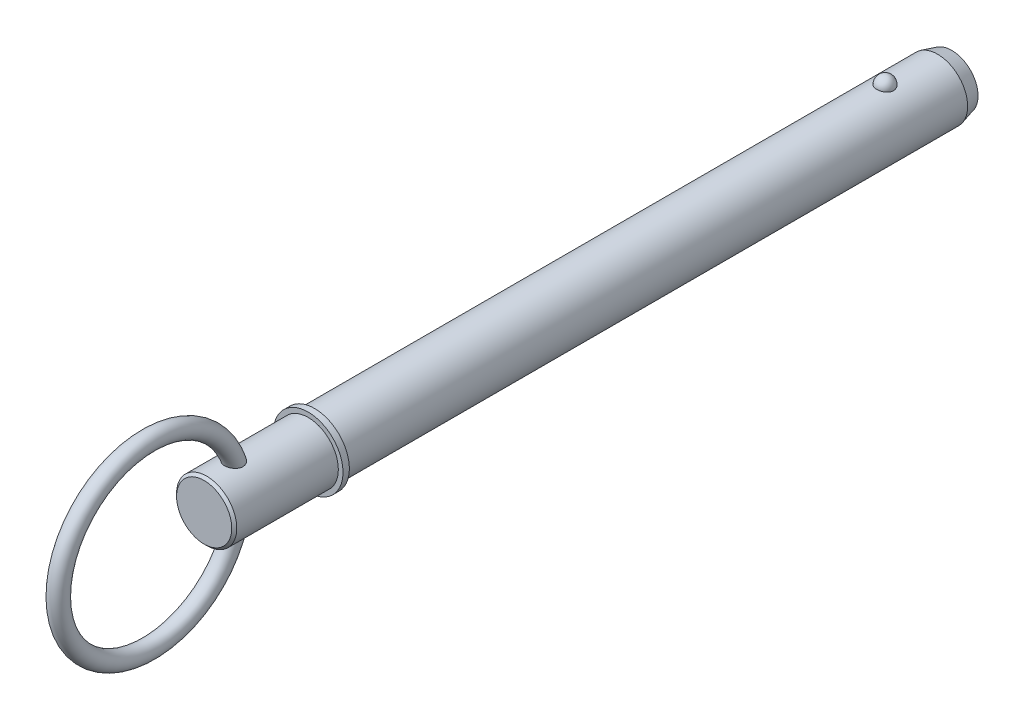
from build123d import *

# Parameters (mm, degrees)
SKETCH2_R           = 9.525
BOSS_EXTRUDE1_DEPTH = 177.8
BOSS_EXTRUDE2_START = 23.8
SKETCH3_R           = 9.525
BOSS_EXTRUDE2_DEPTH = 23.8
CHAMFER1_SIZE       = 4.5
CHAMFER1_SIZE2      = 1.205771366
SKETCH20_W          = 2
SKETCH20_H          = 11
SKETCH21_R          = 9.525
BOSS_EXTRUDE3_DEPTH = 34.93
CHAMFER2_SIZE       = 0.8
SKETCH24_R          = 2.75


with BuildPart() as part:
    # Sketch2 → Boss-Extrude1 (new body)
    with BuildSketch(Plane.XY):
        Circle(SKETCH2_R)
    extrude(amount=BOSS_EXTRUDE1_DEPTH)

    # Sketch3 → Boss-Extrude2 (add)
    with BuildSketch(Plane(origin=(0, 0, 0), x_dir=(-1, 0, 0), z_dir=(0, 0, -1)).offset(BOSS_EXTRUDE2_START)):
        Circle(SKETCH3_R)
    extrude(amount=-BOSS_EXTRUDE2_DEPTH)

    # Chamfer1
    chamfer1_edges = [part.edges().sort_by_distance(p)[0] for p in [
        (9.525, 0, -23.8),
    ]]
    chamfer1_side = [part.faces().sort_by_distance(p)[0] for p in [
        (9.525, 0, -11.9),
    ]]
    chamfer(chamfer1_edges, length=CHAMFER1_SIZE, length2=CHAMFER1_SIZE2, reference=chamfer1_side[0])

    # Sketch18 → Revolve1 (revolve)
    with BuildSketch(Plane(origin=(0, 0, 0), x_dir=(0, 0, -1), z_dir=(1, 0, 0))):
        with BuildLine():
            Line((2.69, 12.215), (2.69, 6.835))
            ThreePointArc((2.69, 6.835), (0, 9.525), (2.69, 12.215))
        make_face()
    revolve(axis=Axis((0, 12.215, -2.69), (0, -1, 0)))

    # Sketch20 → Revolve2 (revolve)
    with BuildSketch(Plane(origin=(0, 0, 0), x_dir=(0, 0, -1), z_dir=(1, 0, 0)), mode=Mode.PRIVATE) as revolve2_sk:
        with Locations((-178.8, 5.5)):
            Rectangle(SKETCH20_W, SKETCH20_H)
    revolve(revolve2_sk.sketch.rotate(Axis((0, 0, 33.728787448), (0, 0, 1)), 90), axis=Axis((0, 0, 33.728787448), (0, 0, 1)))

    # Sketch21 → Boss-Extrude3 (add)
    with BuildSketch(Plane(origin=(0, 0, 177.8), x_dir=(-1, 0, 0), z_dir=(0, 0, -1))):
        Circle(SKETCH21_R)
    extrude(amount=-BOSS_EXTRUDE3_DEPTH)

    # Chamfer2
    chamfer2_edges = [part.edges().sort_by_distance(p)[0] for p in [
        (9.525, 0, 212.73),
    ]]
    chamfer(chamfer2_edges, length=CHAMFER2_SIZE)

    # Sweep1: sweep along a path in Sketch23
    with BuildLine(Plane(origin=(0, 0, 0), x_dir=(0, 0, -1), z_dir=(1, 0, 0))) as sweep1_path:
        CenterArc((-230.305, 0), 28.575, 0, 360)
    # Sketch24 → Sweep1 (sweep)
    with BuildSketch(Plane(origin=(0, 0, 0), x_dir=(1, 0, 0), z_dir=(0, 1, 0))):
        with Locations((0, -201.73)):
            Circle(SKETCH24_R)
    sweep(path=sweep1_path.line)


solid = part.part
